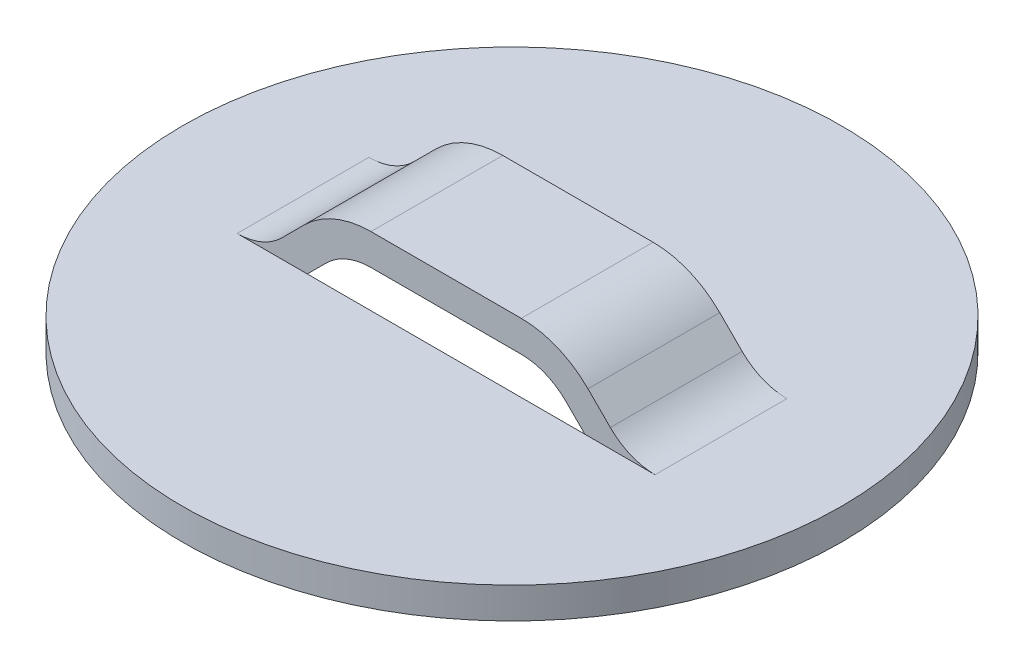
ISO-10303-21;
HEADER;
FILE_DESCRIPTION(('STEP AP214'),'2;1');
FILE_NAME('part.step','',(''),(''),'','','');
FILE_SCHEMA(('AUTOMOTIVE_DESIGN { 1 0 10303 214 1 1 1 1 }'));
ENDSEC;
DATA;
#1=APPLICATION_CONTEXT('core data for automotive mechanical design processes');
#2=APPLICATION_PROTOCOL_DEFINITION('international standard','automotive_design',2000,#1);
#3=PRODUCT_CONTEXT('',#1,'mechanical');
#4=PRODUCT('Part','Part','',(#3));
#5=PRODUCT_RELATED_PRODUCT_CATEGORY('part','',(#4));
#6=PRODUCT_DEFINITION_FORMATION('','',#4);
#7=PRODUCT_DEFINITION_CONTEXT('part definition',#1,'design');
#8=PRODUCT_DEFINITION('design','',#6,#7);
#9=PRODUCT_DEFINITION_SHAPE('','',#8);
#10=(LENGTH_UNIT() NAMED_UNIT(*) SI_UNIT(.MILLI.,.METRE.));
#11=(NAMED_UNIT(*) PLANE_ANGLE_UNIT() SI_UNIT($,.RADIAN.));
#12=(NAMED_UNIT(*) SI_UNIT($,.STERADIAN.) SOLID_ANGLE_UNIT());
#13=UNCERTAINTY_MEASURE_WITH_UNIT(LENGTH_MEASURE(1.E-05),#10,'distance_accuracy_value','');
#14=(GEOMETRIC_REPRESENTATION_CONTEXT(3) GLOBAL_UNCERTAINTY_ASSIGNED_CONTEXT((#13)) GLOBAL_UNIT_ASSIGNED_CONTEXT((#10,
#11,#12)) REPRESENTATION_CONTEXT('',''));
#15=CARTESIAN_POINT('',(0.,0.,0.));
#16=DIRECTION('',(0.,0.,1.));
#17=DIRECTION('',(1.,0.,0.));
#18=AXIS2_PLACEMENT_3D('',#15,#16,#17);
#19=CARTESIAN_POINT('',(5.8077136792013,3.048,6.35));
#20=DIRECTION('',(0.,0.,-1.));
#21=DIRECTION('',(-1.,0.,0.));
#22=AXIS2_PLACEMENT_3D('',#19,#20,#21);
#23=PLANE('',#22);
#24=DIRECTION('',(-1.,0.,0.));
#25=VECTOR('',#24,1.);
#26=CARTESIAN_POINT('',(5.8077136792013,0.,6.35));
#27=LINE('',#26,#25);
#28=CARTESIAN_POINT('',(25.9422863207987,0.,6.35));
#29=VERTEX_POINT('',#28);
#30=CARTESIAN_POINT('',(22.5604229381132,0.,6.35));
#31=VERTEX_POINT('',#30);
#32=EDGE_CURVE('E343',#29,#31,#27,.T.);
#33=ORIENTED_EDGE('',*,*,#32,.F.);
#34=CARTESIAN_POINT('',(25.9422863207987,3.048,6.35));
#35=DIRECTION('',(0.,0.,-1.));
#36=DIRECTION('',(1.,0.,0.));
#37=AXIS2_PLACEMENT_3D('',#34,#35,#36);
#38=CIRCLE('',#37,3.048);
#39=CARTESIAN_POINT('',(23.7870248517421,0.89273853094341,6.35));
#40=VERTEX_POINT('',#39);
#41=EDGE_CURVE('E279',#29,#40,#38,.T.);
#42=ORIENTED_EDGE('',*,*,#41,.T.);
#43=DIRECTION('',(-0.707106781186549,0.707106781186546,0.));
#44=VECTOR('',#43,1.);
#45=CARTESIAN_POINT('',(22.7094316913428,1.97033169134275,6.35));
#46=LINE('',#45,#44);
#47=CARTESIAN_POINT('',(22.7094316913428,1.97033169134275,6.35));
#48=VERTEX_POINT('',#47);
#49=EDGE_CURVE('E281',#40,#48,#46,.T.);
#50=ORIENTED_EDGE('',*,*,#49,.T.);
#51=CARTESIAN_POINT('',(19.4945,-1.2446,6.35));
#52=DIRECTION('',(0.,0.,1.));
#53=DIRECTION('',(-1.,0.,0.));
#54=AXIS2_PLACEMENT_3D('',#51,#52,#53);
#55=CIRCLE('',#54,4.5466);
#56=CARTESIAN_POINT('',(19.4945,3.302,6.35));
#57=VERTEX_POINT('',#56);
#58=EDGE_CURVE('E283',#48,#57,#55,.T.);
#59=ORIENTED_EDGE('',*,*,#58,.T.);
#60=DIRECTION('',(-1.,0.,0.));
#61=VECTOR('',#60,1.);
#62=CARTESIAN_POINT('',(12.2555,3.302,6.35));
#63=LINE('',#62,#61);
#64=CARTESIAN_POINT('',(12.2555,3.302,6.35));
#65=VERTEX_POINT('',#64);
#66=EDGE_CURVE('E285',#57,#65,#63,.T.);
#67=ORIENTED_EDGE('',*,*,#66,.T.);
#68=CARTESIAN_POINT('',(12.2555,-1.2446,6.35));
#69=DIRECTION('',(0.,0.,1.));
#70=DIRECTION('',(-1.,0.,0.));
#71=AXIS2_PLACEMENT_3D('',#68,#69,#70);
#72=CIRCLE('',#71,4.5466);
#73=CARTESIAN_POINT('',(9.04056830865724,1.97033169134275,6.35));
#74=VERTEX_POINT('',#73);
#75=EDGE_CURVE('E287',#65,#74,#72,.T.);
#76=ORIENTED_EDGE('',*,*,#75,.T.);
#77=DIRECTION('',(-0.707106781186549,-0.707106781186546,0.));
#78=VECTOR('',#77,1.);
#79=CARTESIAN_POINT('',(7.9629751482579,0.89273853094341,6.35));
#80=LINE('',#79,#78);
#81=CARTESIAN_POINT('',(7.9629751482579,0.89273853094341,6.35));
#82=VERTEX_POINT('',#81);
#83=EDGE_CURVE('E197',#74,#82,#80,.T.);
#84=ORIENTED_EDGE('',*,*,#83,.T.);
#85=CARTESIAN_POINT('',(5.8077136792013,3.048,6.35));
#86=DIRECTION('',(0.,0.,-1.));
#87=DIRECTION('',(-1.,0.,0.));
#88=AXIS2_PLACEMENT_3D('',#85,#86,#87);
#89=CIRCLE('',#88,3.048);
#90=CARTESIAN_POINT('',(5.8077136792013,0.,6.35));
#91=VERTEX_POINT('',#90);
#92=EDGE_CURVE('E193',#82,#91,#89,.T.);
#93=ORIENTED_EDGE('',*,*,#92,.T.);
#94=CARTESIAN_POINT('',(9.18957706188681,0.,6.35));
#95=VERTEX_POINT('',#94);
#96=EDGE_CURVE('E60',#95,#91,#27,.T.);
#97=ORIENTED_EDGE('',*,*,#96,.F.);
#98=DIRECTION('',(0.707106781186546,0.707106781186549,0.));
#99=VECTOR('',#98,1.);
#100=CARTESIAN_POINT('',(9.02264537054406,-0.166931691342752,6.35));
#101=LINE('',#100,#99);
#102=CARTESIAN_POINT('',(10.1002385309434,0.910661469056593,6.35));
#103=VERTEX_POINT('',#102);
#104=EDGE_CURVE('E267',#95,#103,#101,.T.);
#105=ORIENTED_EDGE('',*,*,#104,.T.);
#106=CARTESIAN_POINT('',(12.2555,-1.2446,6.35));
#107=DIRECTION('',(0.,0.,-1.));
#108=DIRECTION('',(-1.,0.,0.));
#109=AXIS2_PLACEMENT_3D('',#106,#107,#108);
#110=CIRCLE('',#109,3.048);
#111=CARTESIAN_POINT('',(12.2555,1.8034,6.35));
#112=VERTEX_POINT('',#111);
#113=EDGE_CURVE('E270',#103,#112,#110,.T.);
#114=ORIENTED_EDGE('',*,*,#113,.T.);
#115=DIRECTION('',(1.,0.,0.));
#116=VECTOR('',#115,1.);
#117=CARTESIAN_POINT('',(12.2555,1.8034,6.35));
#118=LINE('',#117,#116);
#119=CARTESIAN_POINT('',(19.4945,1.8034,6.35));
#120=VERTEX_POINT('',#119);
#121=EDGE_CURVE('E272',#112,#120,#118,.T.);
#122=ORIENTED_EDGE('',*,*,#121,.T.);
#123=CARTESIAN_POINT('',(19.4945,-1.2446,6.35));
#124=DIRECTION('',(0.,0.,-1.));
#125=DIRECTION('',(-1.,0.,0.));
#126=AXIS2_PLACEMENT_3D('',#123,#124,#125);
#127=CIRCLE('',#126,3.048);
#128=CARTESIAN_POINT('',(21.6497614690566,0.910661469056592,6.35));
#129=VERTEX_POINT('',#128);
#130=EDGE_CURVE('E274',#120,#129,#127,.T.);
#131=ORIENTED_EDGE('',*,*,#130,.T.);
#132=DIRECTION('',(0.707106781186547,-0.707106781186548,0.));
#133=VECTOR('',#132,1.);
#134=CARTESIAN_POINT('',(21.6497614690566,0.910661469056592,6.35));
#135=LINE('',#134,#133);
#136=EDGE_CURVE('E276',#129,#31,#135,.T.);
#137=ORIENTED_EDGE('',*,*,#136,.T.);
#138=EDGE_LOOP('',(#33,#42,#50,#59,#67,#76,#84,#93,#97,#105,#114,#122,#131,#137));
#139=FACE_BOUND('',#138,.T.);
#140=ADVANCED_FACE('F37',(#139),#23,.F.);
#141=CARTESIAN_POINT('',(5.8077136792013,3.048,0.));
#142=DIRECTION('',(0.,0.,-1.));
#143=DIRECTION('',(-1.,0.,0.));
#144=AXIS2_PLACEMENT_3D('',#141,#142,#143);
#145=PLANE('',#144);
#146=CARTESIAN_POINT('',(25.9422863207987,3.048,0.));
#147=DIRECTION('',(0.,0.,-1.));
#148=DIRECTION('',(1.,0.,0.));
#149=AXIS2_PLACEMENT_3D('',#146,#147,#148);
#150=CIRCLE('',#149,3.048);
#151=CARTESIAN_POINT('',(25.9422863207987,0.,0.));
#152=VERTEX_POINT('',#151);
#153=CARTESIAN_POINT('',(23.7870248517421,0.89273853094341,0.));
#154=VERTEX_POINT('',#153);
#155=EDGE_CURVE('E306',#152,#154,#150,.T.);
#156=ORIENTED_EDGE('',*,*,#155,.F.);
#157=DIRECTION('',(-1.,0.,0.));
#158=VECTOR('',#157,1.);
#159=CARTESIAN_POINT('',(5.8077136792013,0.,0.));
#160=LINE('',#159,#158);
#161=CARTESIAN_POINT('',(22.5604229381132,0.,0.));
#162=VERTEX_POINT('',#161);
#163=EDGE_CURVE('E11',#152,#162,#160,.T.);
#164=ORIENTED_EDGE('',*,*,#163,.T.);
#165=DIRECTION('',(0.707106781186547,-0.707106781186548,0.));
#166=VECTOR('',#165,1.);
#167=CARTESIAN_POINT('',(21.6497614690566,0.910661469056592,0.));
#168=LINE('',#167,#166);
#169=CARTESIAN_POINT('',(21.6497614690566,0.910661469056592,0.));
#170=VERTEX_POINT('',#169);
#171=EDGE_CURVE('E300',#170,#162,#168,.T.);
#172=ORIENTED_EDGE('',*,*,#171,.F.);
#173=CARTESIAN_POINT('',(19.4945,-1.2446,0.));
#174=DIRECTION('',(0.,0.,-1.));
#175=DIRECTION('',(-1.,0.,0.));
#176=AXIS2_PLACEMENT_3D('',#173,#174,#175);
#177=CIRCLE('',#176,3.048);
#178=CARTESIAN_POINT('',(19.4945,1.8034,0.));
#179=VERTEX_POINT('',#178);
#180=EDGE_CURVE('E297',#179,#170,#177,.T.);
#181=ORIENTED_EDGE('',*,*,#180,.F.);
#182=DIRECTION('',(1.,0.,0.));
#183=VECTOR('',#182,1.);
#184=CARTESIAN_POINT('',(12.2555,1.8034,0.));
#185=LINE('',#184,#183);
#186=CARTESIAN_POINT('',(12.2555,1.8034,0.));
#187=VERTEX_POINT('',#186);
#188=EDGE_CURVE('E295',#187,#179,#185,.T.);
#189=ORIENTED_EDGE('',*,*,#188,.F.);
#190=CARTESIAN_POINT('',(12.2555,-1.2446,0.));
#191=DIRECTION('',(0.,0.,-1.));
#192=DIRECTION('',(-1.,0.,0.));
#193=AXIS2_PLACEMENT_3D('',#190,#191,#192);
#194=CIRCLE('',#193,3.048);
#195=CARTESIAN_POINT('',(10.1002385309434,0.910661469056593,0.));
#196=VERTEX_POINT('',#195);
#197=EDGE_CURVE('E293',#196,#187,#194,.T.);
#198=ORIENTED_EDGE('',*,*,#197,.F.);
#199=DIRECTION('',(0.707106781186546,0.707106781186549,0.));
#200=VECTOR('',#199,1.);
#201=CARTESIAN_POINT('',(9.02264537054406,-0.166931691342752,0.));
#202=LINE('',#201,#200);
#203=CARTESIAN_POINT('',(9.18957706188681,0.,0.));
#204=VERTEX_POINT('',#203);
#205=EDGE_CURVE('E171',#204,#196,#202,.T.);
#206=ORIENTED_EDGE('',*,*,#205,.F.);
#207=DIRECTION('',(1.,0.,0.));
#208=VECTOR('',#207,1.);
#209=CARTESIAN_POINT('',(5.8077136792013,0.,0.));
#210=LINE('',#209,#208);
#211=CARTESIAN_POINT('',(5.8077136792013,0.,0.));
#212=VERTEX_POINT('',#211);
#213=EDGE_CURVE('E164',#212,#204,#210,.T.);
#214=ORIENTED_EDGE('',*,*,#213,.F.);
#215=CARTESIAN_POINT('',(5.8077136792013,3.048,0.));
#216=DIRECTION('',(0.,0.,-1.));
#217=DIRECTION('',(-1.,0.,0.));
#218=AXIS2_PLACEMENT_3D('',#215,#216,#217);
#219=CIRCLE('',#218,3.048);
#220=CARTESIAN_POINT('',(7.9629751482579,0.89273853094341,0.));
#221=VERTEX_POINT('',#220);
#222=EDGE_CURVE('E169',#221,#212,#219,.T.);
#223=ORIENTED_EDGE('',*,*,#222,.F.);
#224=DIRECTION('',(-0.707106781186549,-0.707106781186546,0.));
#225=VECTOR('',#224,1.);
#226=CARTESIAN_POINT('',(7.9629751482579,0.89273853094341,0.));
#227=LINE('',#226,#225);
#228=CARTESIAN_POINT('',(9.04056830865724,1.97033169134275,0.));
#229=VERTEX_POINT('',#228);
#230=EDGE_CURVE('E188',#229,#221,#227,.T.);
#231=ORIENTED_EDGE('',*,*,#230,.F.);
#232=CARTESIAN_POINT('',(12.2555,-1.2446,0.));
#233=DIRECTION('',(0.,0.,1.));
#234=DIRECTION('',(-1.,0.,0.));
#235=AXIS2_PLACEMENT_3D('',#232,#233,#234);
#236=CIRCLE('',#235,4.5466);
#237=CARTESIAN_POINT('',(12.2555,3.302,0.));
#238=VERTEX_POINT('',#237);
#239=EDGE_CURVE('E314',#238,#229,#236,.T.);
#240=ORIENTED_EDGE('',*,*,#239,.F.);
#241=DIRECTION('',(-1.,0.,0.));
#242=VECTOR('',#241,1.);
#243=CARTESIAN_POINT('',(12.2555,3.302,0.));
#244=LINE('',#243,#242);
#245=CARTESIAN_POINT('',(19.4945,3.302,0.));
#246=VERTEX_POINT('',#245);
#247=EDGE_CURVE('E312',#246,#238,#244,.T.);
#248=ORIENTED_EDGE('',*,*,#247,.F.);
#249=CARTESIAN_POINT('',(19.4945,-1.2446,0.));
#250=DIRECTION('',(0.,0.,1.));
#251=DIRECTION('',(-1.,0.,0.));
#252=AXIS2_PLACEMENT_3D('',#249,#250,#251);
#253=CIRCLE('',#252,4.5466);
#254=CARTESIAN_POINT('',(22.7094316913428,1.97033169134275,0.));
#255=VERTEX_POINT('',#254);
#256=EDGE_CURVE('E310',#255,#246,#253,.T.);
#257=ORIENTED_EDGE('',*,*,#256,.F.);
#258=DIRECTION('',(-0.707106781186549,0.707106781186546,0.));
#259=VECTOR('',#258,1.);
#260=CARTESIAN_POINT('',(22.7094316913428,1.97033169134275,0.));
#261=LINE('',#260,#259);
#262=EDGE_CURVE('E308',#154,#255,#261,.T.);
#263=ORIENTED_EDGE('',*,*,#262,.F.);
#264=EDGE_LOOP('',(#156,#164,#172,#181,#189,#198,#206,#214,#223,#231,#240,#248,#257,#263));
#265=FACE_BOUND('',#264,.T.);
#266=ADVANCED_FACE('F167',(#265),#145,.T.);
#267=CARTESIAN_POINT('',(5.8077136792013,3.048,6.35));
#268=DIRECTION('',(0.,0.,-1.));
#269=DIRECTION('',(-1.,0.,0.));
#270=AXIS2_PLACEMENT_3D('',#267,#268,#269);
#271=CYLINDRICAL_SURFACE('',#270,4.5466);
#272=CARTESIAN_POINT('',(5.8077136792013,3.048,0.));
#273=DIRECTION('',(0.,0.,1.));
#274=DIRECTION('',(-1.,0.,0.));
#275=AXIS2_PLACEMENT_3D('',#272,#273,#274);
#276=CIRCLE('',#275,4.5466);
#277=CARTESIAN_POINT('',(5.8077136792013,-1.4986,0.));
#278=VERTEX_POINT('',#277);
#279=CARTESIAN_POINT('',(9.02264537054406,-0.166931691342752,0.));
#280=VERTEX_POINT('',#279);
#281=EDGE_CURVE('E243',#278,#280,#276,.T.);
#282=ORIENTED_EDGE('',*,*,#281,.T.);
#283=DIRECTION('',(0.,0.,-1.));
#284=VECTOR('',#283,1.);
#285=CARTESIAN_POINT('',(9.02264537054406,-0.166931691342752,6.35));
#286=LINE('',#285,#284);
#287=CARTESIAN_POINT('',(9.02264537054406,-0.166931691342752,6.35));
#288=VERTEX_POINT('',#287);
#289=EDGE_CURVE('E236',#288,#280,#286,.T.);
#290=ORIENTED_EDGE('',*,*,#289,.F.);
#291=CARTESIAN_POINT('',(5.8077136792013,3.048,6.35));
#292=DIRECTION('',(0.,0.,1.));
#293=DIRECTION('',(-1.,0.,0.));
#294=AXIS2_PLACEMENT_3D('',#291,#292,#293);
#295=CIRCLE('',#294,4.5466);
#296=CARTESIAN_POINT('',(5.8077136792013,-1.4986,6.35));
#297=VERTEX_POINT('',#296);
#298=EDGE_CURVE('E187',#297,#288,#295,.T.);
#299=ORIENTED_EDGE('',*,*,#298,.F.);
#300=DIRECTION('',(0.,0.,-1.));
#301=VECTOR('',#300,1.);
#302=CARTESIAN_POINT('',(5.8077136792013,-1.4986,6.35));
#303=LINE('',#302,#301);
#304=EDGE_CURVE('E45',#297,#278,#303,.T.);
#305=ORIENTED_EDGE('',*,*,#304,.T.);
#306=EDGE_LOOP('',(#282,#290,#299,#305));
#307=FACE_BOUND('',#306,.T.);
#308=ADVANCED_FACE('F39',(#307),#271,.T.);
#309=CARTESIAN_POINT('',(9.02264537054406,-0.166931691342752,6.35));
#310=DIRECTION('',(-0.707106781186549,0.707106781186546,0.));
#311=DIRECTION('',(-0.707106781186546,-0.707106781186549,0.));
#312=AXIS2_PLACEMENT_3D('',#309,#310,#311);
#313=PLANE('',#312);
#314=EDGE_CURVE('E291',#280,#204,#202,.T.);
#315=ORIENTED_EDGE('',*,*,#314,.T.);
#316=ORIENTED_EDGE('',*,*,#205,.T.);
#317=DIRECTION('',(0.,0.,-1.));
#318=VECTOR('',#317,1.);
#319=CARTESIAN_POINT('',(10.1002385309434,0.910661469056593,6.35));
#320=LINE('',#319,#318);
#321=EDGE_CURVE('E233',#103,#196,#320,.T.);
#322=ORIENTED_EDGE('',*,*,#321,.F.);
#323=ORIENTED_EDGE('',*,*,#104,.F.);
#324=EDGE_CURVE('E268',#288,#95,#101,.T.);
#325=ORIENTED_EDGE('',*,*,#324,.F.);
#326=ORIENTED_EDGE('',*,*,#289,.T.);
#327=EDGE_LOOP('',(#315,#316,#322,#323,#325,#326));
#328=FACE_BOUND('',#327,.T.);
#329=ADVANCED_FACE('F363',(#328),#313,.F.);
#330=CARTESIAN_POINT('',(12.2555,-1.2446,6.35));
#331=DIRECTION('',(0.,0.,-1.));
#332=DIRECTION('',(-1.,0.,0.));
#333=AXIS2_PLACEMENT_3D('',#330,#331,#332);
#334=CYLINDRICAL_SURFACE('',#333,3.048);
#335=ORIENTED_EDGE('',*,*,#197,.T.);
#336=DIRECTION('',(0.,0.,-1.));
#337=VECTOR('',#336,1.);
#338=CARTESIAN_POINT('',(12.2555,1.8034,6.35));
#339=LINE('',#338,#337);
#340=EDGE_CURVE('E230',#112,#187,#339,.T.);
#341=ORIENTED_EDGE('',*,*,#340,.F.);
#342=ORIENTED_EDGE('',*,*,#113,.F.);
#343=ORIENTED_EDGE('',*,*,#321,.T.);
#344=EDGE_LOOP('',(#335,#341,#342,#343));
#345=FACE_BOUND('',#344,.T.);
#346=ADVANCED_FACE('F360',(#345),#334,.F.);
#347=CARTESIAN_POINT('',(12.2555,1.8034,6.35));
#348=DIRECTION('',(0.,1.,0.));
#349=DIRECTION('',(-1.,0.,0.));
#350=AXIS2_PLACEMENT_3D('',#347,#348,#349);
#351=PLANE('',#350);
#352=ORIENTED_EDGE('',*,*,#188,.T.);
#353=DIRECTION('',(0.,0.,-1.));
#354=VECTOR('',#353,1.);
#355=CARTESIAN_POINT('',(19.4945,1.8034,6.35));
#356=LINE('',#355,#354);
#357=EDGE_CURVE('E227',#120,#179,#356,.T.);
#358=ORIENTED_EDGE('',*,*,#357,.F.);
#359=ORIENTED_EDGE('',*,*,#121,.F.);
#360=ORIENTED_EDGE('',*,*,#340,.T.);
#361=EDGE_LOOP('',(#352,#358,#359,#360));
#362=FACE_BOUND('',#361,.T.);
#363=ADVANCED_FACE('F355',(#362),#351,.F.);
#364=CARTESIAN_POINT('',(19.4945,-1.2446,6.35));
#365=DIRECTION('',(0.,0.,-1.));
#366=DIRECTION('',(-1.,0.,0.));
#367=AXIS2_PLACEMENT_3D('',#364,#365,#366);
#368=CYLINDRICAL_SURFACE('',#367,3.048);
#369=ORIENTED_EDGE('',*,*,#180,.T.);
#370=DIRECTION('',(0.,0.,-1.));
#371=VECTOR('',#370,1.);
#372=CARTESIAN_POINT('',(21.6497614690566,0.910661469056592,6.35));
#373=LINE('',#372,#371);
#374=EDGE_CURVE('E224',#129,#170,#373,.T.);
#375=ORIENTED_EDGE('',*,*,#374,.F.);
#376=ORIENTED_EDGE('',*,*,#130,.F.);
#377=ORIENTED_EDGE('',*,*,#357,.T.);
#378=EDGE_LOOP('',(#369,#375,#376,#377));
#379=FACE_BOUND('',#378,.T.);
#380=ADVANCED_FACE('F351',(#379),#368,.F.);
#381=CARTESIAN_POINT('',(21.6497614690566,0.910661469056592,6.35));
#382=DIRECTION('',(0.707106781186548,0.707106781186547,0.));
#383=DIRECTION('',(-0.707106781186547,0.707106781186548,0.));
#384=AXIS2_PLACEMENT_3D('',#381,#382,#383);
#385=PLANE('',#384);
#386=ORIENTED_EDGE('',*,*,#171,.T.);
#387=CARTESIAN_POINT('',(22.7273546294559,-0.166931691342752,0.));
#388=VERTEX_POINT('',#387);
#389=EDGE_CURVE('E299',#162,#388,#168,.T.);
#390=ORIENTED_EDGE('',*,*,#389,.T.);
#391=DIRECTION('',(0.,0.,-1.));
#392=VECTOR('',#391,1.);
#393=CARTESIAN_POINT('',(22.7273546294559,-0.16693169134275,6.35));
#394=LINE('',#393,#392);
#395=CARTESIAN_POINT('',(22.7273546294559,-0.16693169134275,6.35));
#396=VERTEX_POINT('',#395);
#397=EDGE_CURVE('E221',#396,#388,#394,.T.);
#398=ORIENTED_EDGE('',*,*,#397,.F.);
#399=EDGE_CURVE('E52',#31,#396,#135,.T.);
#400=ORIENTED_EDGE('',*,*,#399,.F.);
#401=ORIENTED_EDGE('',*,*,#136,.F.);
#402=ORIENTED_EDGE('',*,*,#374,.T.);
#403=EDGE_LOOP('',(#386,#390,#398,#400,#401,#402));
#404=FACE_BOUND('',#403,.T.);
#405=ADVANCED_FACE('F347',(#404),#385,.F.);
#406=CARTESIAN_POINT('',(25.9422863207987,3.048,6.35));
#407=DIRECTION('',(0.,0.,-1.));
#408=DIRECTION('',(-1.,0.,0.));
#409=AXIS2_PLACEMENT_3D('',#406,#407,#408);
#410=CYLINDRICAL_SURFACE('',#409,4.5466);
#411=CARTESIAN_POINT('',(25.9422863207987,3.048,0.));
#412=DIRECTION('',(0.,0.,1.));
#413=DIRECTION('',(1.,0.,0.));
#414=AXIS2_PLACEMENT_3D('',#411,#412,#413);
#415=CIRCLE('',#414,4.5466);
#416=CARTESIAN_POINT('',(25.9422863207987,-1.4986,0.));
#417=VERTEX_POINT('',#416);
#418=EDGE_CURVE('E303',#388,#417,#415,.T.);
#419=ORIENTED_EDGE('',*,*,#418,.T.);
#420=DIRECTION('',(0.,0.,-1.));
#421=VECTOR('',#420,1.);
#422=CARTESIAN_POINT('',(25.9422863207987,-1.4986,6.35));
#423=LINE('',#422,#421);
#424=CARTESIAN_POINT('',(25.9422863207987,-1.4986,6.35));
#425=VERTEX_POINT('',#424);
#426=EDGE_CURVE('E218',#425,#417,#423,.T.);
#427=ORIENTED_EDGE('',*,*,#426,.F.);
#428=CARTESIAN_POINT('',(25.9422863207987,3.048,6.35));
#429=DIRECTION('',(0.,0.,1.));
#430=DIRECTION('',(1.,0.,0.));
#431=AXIS2_PLACEMENT_3D('',#428,#429,#430);
#432=CIRCLE('',#431,4.5466);
#433=EDGE_CURVE('E256',#396,#425,#432,.T.);
#434=ORIENTED_EDGE('',*,*,#433,.F.);
#435=ORIENTED_EDGE('',*,*,#397,.T.);
#436=EDGE_LOOP('',(#419,#427,#434,#435));
#437=FACE_BOUND('',#436,.T.);
#438=ADVANCED_FACE('F370',(#437),#410,.T.);
#439=CARTESIAN_POINT('',(25.9422863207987,-1.4986,6.35));
#440=DIRECTION('',(0.,1.,0.));
#441=DIRECTION('',(-1.,0.,0.));
#442=AXIS2_PLACEMENT_3D('',#439,#440,#441);
#443=PLANE('',#442);
#444=CARTESIAN_POINT('',(15.875,-1.4986,3.175));
#445=DIRECTION('',(0.,-1.,0.));
#446=DIRECTION('',(1.,0.,0.));
#447=AXIS2_PLACEMENT_3D('',#444,#445,#446);
#448=CIRCLE('',#447,15.875);
#449=CARTESIAN_POINT('',(31.75,-1.4986,3.175));
#450=VERTEX_POINT('',#449);
#451=EDGE_CURVE('E176',#450,#450,#448,.T.);
#452=ORIENTED_EDGE('',*,*,#451,.T.);
#453=EDGE_LOOP('',(#452));
#454=FACE_BOUND('',#453,.T.);
#455=DIRECTION('',(-1.,0.,0.));
#456=VECTOR('',#455,1.);
#457=CARTESIAN_POINT('',(5.8077136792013,-1.4986,6.35));
#458=LINE('',#457,#456);
#459=EDGE_CURVE('E249',#425,#297,#458,.T.);
#460=ORIENTED_EDGE('',*,*,#459,.F.);
#461=ORIENTED_EDGE('',*,*,#426,.T.);
#462=DIRECTION('',(1.,0.,0.));
#463=VECTOR('',#462,1.);
#464=CARTESIAN_POINT('',(5.8077136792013,-1.4986,0.));
#465=LINE('',#464,#463);
#466=EDGE_CURVE('E250',#278,#417,#465,.T.);
#467=ORIENTED_EDGE('',*,*,#466,.F.);
#468=ORIENTED_EDGE('',*,*,#304,.F.);
#469=EDGE_LOOP('',(#460,#461,#467,#468));
#470=FACE_BOUND('',#469,.T.);
#471=ADVANCED_FACE('F248',(#454,#470),#443,.F.);
#472=CARTESIAN_POINT('',(25.9422863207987,3.048,6.35));
#473=DIRECTION('',(0.,0.,-1.));
#474=DIRECTION('',(-1.,0.,0.));
#475=AXIS2_PLACEMENT_3D('',#472,#473,#474);
#476=CYLINDRICAL_SURFACE('',#475,3.048);
#477=ORIENTED_EDGE('',*,*,#155,.T.);
#478=DIRECTION('',(0.,0.,-1.));
#479=VECTOR('',#478,1.);
#480=CARTESIAN_POINT('',(23.7870248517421,0.89273853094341,6.35));
#481=LINE('',#480,#479);
#482=EDGE_CURVE('E212',#40,#154,#481,.T.);
#483=ORIENTED_EDGE('',*,*,#482,.F.);
#484=ORIENTED_EDGE('',*,*,#41,.F.);
#485=DIRECTION('',(0.,0.,-1.));
#486=VECTOR('',#485,1.);
#487=CARTESIAN_POINT('',(25.9422863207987,0.,6.35));
#488=LINE('',#487,#486);
#489=EDGE_CURVE('E215',#29,#152,#488,.T.);
#490=ORIENTED_EDGE('',*,*,#489,.T.);
#491=EDGE_LOOP('',(#477,#483,#484,#490));
#492=FACE_BOUND('',#491,.T.);
#493=ADVANCED_FACE('F341',(#492),#476,.F.);
#494=CARTESIAN_POINT('',(22.7094316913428,1.97033169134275,6.35));
#495=DIRECTION('',(-0.707106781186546,-0.707106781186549,0.));
#496=DIRECTION('',(0.707106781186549,-0.707106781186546,0.));
#497=AXIS2_PLACEMENT_3D('',#494,#495,#496);
#498=PLANE('',#497);
#499=ORIENTED_EDGE('',*,*,#262,.T.);
#500=DIRECTION('',(0.,0.,-1.));
#501=VECTOR('',#500,1.);
#502=CARTESIAN_POINT('',(22.7094316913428,1.97033169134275,6.35));
#503=LINE('',#502,#501);
#504=EDGE_CURVE('E209',#48,#255,#503,.T.);
#505=ORIENTED_EDGE('',*,*,#504,.F.);
#506=ORIENTED_EDGE('',*,*,#49,.F.);
#507=ORIENTED_EDGE('',*,*,#482,.T.);
#508=EDGE_LOOP('',(#499,#505,#506,#507));
#509=FACE_BOUND('',#508,.T.);
#510=ADVANCED_FACE('F336',(#509),#498,.F.);
#511=CARTESIAN_POINT('',(19.4945,-1.2446,6.35));
#512=DIRECTION('',(0.,0.,-1.));
#513=DIRECTION('',(-1.,0.,0.));
#514=AXIS2_PLACEMENT_3D('',#511,#512,#513);
#515=CYLINDRICAL_SURFACE('',#514,4.5466);
#516=ORIENTED_EDGE('',*,*,#256,.T.);
#517=DIRECTION('',(0.,0.,-1.));
#518=VECTOR('',#517,1.);
#519=CARTESIAN_POINT('',(19.4945,3.302,6.35));
#520=LINE('',#519,#518);
#521=EDGE_CURVE('E206',#57,#246,#520,.T.);
#522=ORIENTED_EDGE('',*,*,#521,.F.);
#523=ORIENTED_EDGE('',*,*,#58,.F.);
#524=ORIENTED_EDGE('',*,*,#504,.T.);
#525=EDGE_LOOP('',(#516,#522,#523,#524));
#526=FACE_BOUND('',#525,.T.);
#527=ADVANCED_FACE('F332',(#526),#515,.T.);
#528=CARTESIAN_POINT('',(12.2555,3.302,6.35));
#529=DIRECTION('',(0.,-1.,0.));
#530=DIRECTION('',(0.,0.,-1.));
#531=AXIS2_PLACEMENT_3D('',#528,#529,#530);
#532=PLANE('',#531);
#533=ORIENTED_EDGE('',*,*,#247,.T.);
#534=DIRECTION('',(0.,0.,-1.));
#535=VECTOR('',#534,1.);
#536=CARTESIAN_POINT('',(12.2555,3.302,6.35));
#537=LINE('',#536,#535);
#538=EDGE_CURVE('E203',#65,#238,#537,.T.);
#539=ORIENTED_EDGE('',*,*,#538,.F.);
#540=ORIENTED_EDGE('',*,*,#66,.F.);
#541=ORIENTED_EDGE('',*,*,#521,.T.);
#542=EDGE_LOOP('',(#533,#539,#540,#541));
#543=FACE_BOUND('',#542,.T.);
#544=ADVANCED_FACE('F328',(#543),#532,.F.);
#545=CARTESIAN_POINT('',(12.2555,-1.2446,6.35));
#546=DIRECTION('',(0.,0.,-1.));
#547=DIRECTION('',(-1.,0.,0.));
#548=AXIS2_PLACEMENT_3D('',#545,#546,#547);
#549=CYLINDRICAL_SURFACE('',#548,4.5466);
#550=ORIENTED_EDGE('',*,*,#239,.T.);
#551=DIRECTION('',(0.,0.,-1.));
#552=VECTOR('',#551,1.);
#553=CARTESIAN_POINT('',(9.04056830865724,1.97033169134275,6.35));
#554=LINE('',#553,#552);
#555=EDGE_CURVE('E195',#74,#229,#554,.T.);
#556=ORIENTED_EDGE('',*,*,#555,.F.);
#557=ORIENTED_EDGE('',*,*,#75,.F.);
#558=ORIENTED_EDGE('',*,*,#538,.T.);
#559=EDGE_LOOP('',(#550,#556,#557,#558));
#560=FACE_BOUND('',#559,.T.);
#561=ADVANCED_FACE('F323',(#560),#549,.T.);
#562=CARTESIAN_POINT('',(7.9629751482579,0.89273853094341,6.35));
#563=DIRECTION('',(0.707106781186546,-0.707106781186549,0.));
#564=DIRECTION('',(0.707106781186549,0.707106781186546,0.));
#565=AXIS2_PLACEMENT_3D('',#562,#563,#564);
#566=PLANE('',#565);
#567=ORIENTED_EDGE('',*,*,#230,.T.);
#568=DIRECTION('',(0.,0.,-1.));
#569=VECTOR('',#568,1.);
#570=CARTESIAN_POINT('',(7.9629751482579,0.89273853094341,6.35));
#571=LINE('',#570,#569);
#572=EDGE_CURVE('E186',#82,#221,#571,.T.);
#573=ORIENTED_EDGE('',*,*,#572,.F.);
#574=ORIENTED_EDGE('',*,*,#83,.F.);
#575=ORIENTED_EDGE('',*,*,#555,.T.);
#576=EDGE_LOOP('',(#567,#573,#574,#575));
#577=FACE_BOUND('',#576,.T.);
#578=ADVANCED_FACE('F316',(#577),#566,.F.);
#579=CARTESIAN_POINT('',(5.8077136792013,3.048,6.35));
#580=DIRECTION('',(0.,0.,-1.));
#581=DIRECTION('',(-1.,0.,0.));
#582=AXIS2_PLACEMENT_3D('',#579,#580,#581);
#583=CYLINDRICAL_SURFACE('',#582,3.048);
#584=ORIENTED_EDGE('',*,*,#222,.T.);
#585=DIRECTION('',(0.,0.,-1.));
#586=VECTOR('',#585,1.);
#587=CARTESIAN_POINT('',(5.8077136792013,0.,6.35));
#588=LINE('',#587,#586);
#589=EDGE_CURVE('E184',#91,#212,#588,.T.);
#590=ORIENTED_EDGE('',*,*,#589,.F.);
#591=ORIENTED_EDGE('',*,*,#92,.F.);
#592=ORIENTED_EDGE('',*,*,#572,.T.);
#593=EDGE_LOOP('',(#584,#590,#591,#592));
#594=FACE_BOUND('',#593,.T.);
#595=ADVANCED_FACE('F182',(#594),#583,.F.);
#596=CARTESIAN_POINT('',(0.,0.,6.35));
#597=DIRECTION('',(0.,-1.,0.));
#598=DIRECTION('',(0.,0.,-1.));
#599=AXIS2_PLACEMENT_3D('',#596,#597,#598);
#600=PLANE('',#599);
#601=CARTESIAN_POINT('',(15.875,0.,3.175));
#602=DIRECTION('',(0.,-1.,0.));
#603=DIRECTION('',(1.,0.,0.));
#604=AXIS2_PLACEMENT_3D('',#601,#602,#603);
#605=CIRCLE('',#604,15.875);
#606=CARTESIAN_POINT('',(31.75,0.,3.175));
#607=VERTEX_POINT('',#606);
#608=EDGE_CURVE('E261',#607,#607,#605,.T.);
#609=ORIENTED_EDGE('',*,*,#608,.F.);
#610=EDGE_LOOP('',(#609));
#611=FACE_BOUND('',#610,.T.);
#612=ORIENTED_EDGE('',*,*,#489,.F.);
#613=ORIENTED_EDGE('',*,*,#32,.T.);
#614=EDGE_CURVE('E367',#31,#95,#27,.T.);
#615=ORIENTED_EDGE('',*,*,#614,.T.);
#616=ORIENTED_EDGE('',*,*,#96,.T.);
#617=ORIENTED_EDGE('',*,*,#589,.T.);
#618=ORIENTED_EDGE('',*,*,#213,.T.);
#619=EDGE_CURVE('E177',#204,#162,#210,.T.);
#620=ORIENTED_EDGE('',*,*,#619,.T.);
#621=ORIENTED_EDGE('',*,*,#163,.F.);
#622=EDGE_LOOP('',(#612,#613,#615,#616,#617,#618,#620,#621));
#623=FACE_BOUND('',#622,.T.);
#624=ADVANCED_FACE('F191',(#611,#623),#600,.F.);
#625=CARTESIAN_POINT('',(5.8077136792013,0.,0.));
#626=DIRECTION('',(0.,0.,-1.));
#627=DIRECTION('',(-1.,0.,0.));
#628=AXIS2_PLACEMENT_3D('',#625,#626,#627);
#629=PLANE('',#628);
#630=ORIENTED_EDGE('',*,*,#314,.F.);
#631=ORIENTED_EDGE('',*,*,#281,.F.);
#632=ORIENTED_EDGE('',*,*,#466,.T.);
#633=ORIENTED_EDGE('',*,*,#418,.F.);
#634=ORIENTED_EDGE('',*,*,#389,.F.);
#635=ORIENTED_EDGE('',*,*,#619,.F.);
#636=EDGE_LOOP('',(#630,#631,#632,#633,#634,#635));
#637=FACE_BOUND('',#636,.T.);
#638=ADVANCED_FACE('F366',(#637),#629,.F.);
#639=CARTESIAN_POINT('',(5.8077136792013,0.,6.35));
#640=DIRECTION('',(0.,0.,1.));
#641=DIRECTION('',(1.,0.,0.));
#642=AXIS2_PLACEMENT_3D('',#639,#640,#641);
#643=PLANE('',#642);
#644=ORIENTED_EDGE('',*,*,#459,.T.);
#645=ORIENTED_EDGE('',*,*,#298,.T.);
#646=ORIENTED_EDGE('',*,*,#324,.T.);
#647=ORIENTED_EDGE('',*,*,#614,.F.);
#648=ORIENTED_EDGE('',*,*,#399,.T.);
#649=ORIENTED_EDGE('',*,*,#433,.T.);
#650=EDGE_LOOP('',(#644,#645,#646,#647,#648,#649));
#651=FACE_BOUND('',#650,.T.);
#652=ADVANCED_FACE('F253',(#651),#643,.F.);
#653=CARTESIAN_POINT('',(15.875,0.,3.175));
#654=DIRECTION('',(0.,-1.,0.));
#655=DIRECTION('',(1.,0.,0.));
#656=AXIS2_PLACEMENT_3D('',#653,#654,#655);
#657=CYLINDRICAL_SURFACE('',#656,15.875);
#658=CARTESIAN_POINT('',(31.75,-1.4986,3.175));
#659=CARTESIAN_POINT('',(31.75,-1.48298958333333,3.175));
#660=CARTESIAN_POINT('',(31.75,-1.46737916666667,3.175));
#661=CARTESIAN_POINT('',(31.75,-1.43615833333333,3.175));
#662=CARTESIAN_POINT('',(31.75,-1.42054791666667,3.175));
#663=CARTESIAN_POINT('',(31.75,-1.38932708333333,3.175));
#664=CARTESIAN_POINT('',(31.75,-1.37371666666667,3.175));
#665=CARTESIAN_POINT('',(31.75,-1.34249583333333,3.175));
#666=CARTESIAN_POINT('',(31.75,-1.32688541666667,3.175));
#667=CARTESIAN_POINT('',(31.75,-1.29566458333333,3.175));
#668=CARTESIAN_POINT('',(31.75,-1.28005416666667,3.175));
#669=CARTESIAN_POINT('',(31.75,-1.24883333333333,3.175));
#670=CARTESIAN_POINT('',(31.75,-1.23322291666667,3.175));
#671=CARTESIAN_POINT('',(31.75,-1.20200208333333,3.175));
#672=CARTESIAN_POINT('',(31.75,-1.18639166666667,3.175));
#673=CARTESIAN_POINT('',(31.75,-1.15517083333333,3.175));
#674=CARTESIAN_POINT('',(31.75,-1.13956041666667,3.175));
#675=CARTESIAN_POINT('',(31.75,-1.10833958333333,3.175));
#676=CARTESIAN_POINT('',(31.75,-1.09272916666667,3.175));
#677=CARTESIAN_POINT('',(31.75,-1.06150833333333,3.175));
#678=CARTESIAN_POINT('',(31.75,-1.04589791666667,3.175));
#679=CARTESIAN_POINT('',(31.75,-1.01467708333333,3.175));
#680=CARTESIAN_POINT('',(31.75,-0.999066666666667,3.175));
#681=CARTESIAN_POINT('',(31.75,-0.967845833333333,3.175));
#682=CARTESIAN_POINT('',(31.75,-0.952235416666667,3.175));
#683=CARTESIAN_POINT('',(31.75,-0.921014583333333,3.175));
#684=CARTESIAN_POINT('',(31.75,-0.905404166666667,3.175));
#685=CARTESIAN_POINT('',(31.75,-0.874183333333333,3.175));
#686=CARTESIAN_POINT('',(31.75,-0.858572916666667,3.175));
#687=CARTESIAN_POINT('',(31.75,-0.827352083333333,3.175));
#688=CARTESIAN_POINT('',(31.75,-0.811741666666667,3.175));
#689=CARTESIAN_POINT('',(31.75,-0.780520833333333,3.175));
#690=CARTESIAN_POINT('',(31.75,-0.764910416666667,3.175));
#691=CARTESIAN_POINT('',(31.75,-0.733689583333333,3.175));
#692=CARTESIAN_POINT('',(31.75,-0.718079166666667,3.175));
#693=CARTESIAN_POINT('',(31.75,-0.686858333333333,3.175));
#694=CARTESIAN_POINT('',(31.75,-0.671247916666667,3.175));
#695=CARTESIAN_POINT('',(31.75,-0.640027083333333,3.175));
#696=CARTESIAN_POINT('',(31.75,-0.624416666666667,3.175));
#697=CARTESIAN_POINT('',(31.75,-0.593195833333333,3.175));
#698=CARTESIAN_POINT('',(31.75,-0.577585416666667,3.175));
#699=CARTESIAN_POINT('',(31.75,-0.546364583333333,3.175));
#700=CARTESIAN_POINT('',(31.75,-0.530754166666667,3.175));
#701=CARTESIAN_POINT('',(31.75,-0.499533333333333,3.175));
#702=CARTESIAN_POINT('',(31.75,-0.483922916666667,3.175));
#703=CARTESIAN_POINT('',(31.75,-0.452702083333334,3.175));
#704=CARTESIAN_POINT('',(31.75,-0.437091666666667,3.175));
#705=CARTESIAN_POINT('',(31.75,-0.405870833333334,3.175));
#706=CARTESIAN_POINT('',(31.75,-0.390260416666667,3.175));
#707=CARTESIAN_POINT('',(31.75,-0.359039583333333,3.175));
#708=CARTESIAN_POINT('',(31.75,-0.343429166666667,3.175));
#709=CARTESIAN_POINT('',(31.75,-0.312208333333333,3.175));
#710=CARTESIAN_POINT('',(31.75,-0.296597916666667,3.175));
#711=CARTESIAN_POINT('',(31.75,-0.265377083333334,3.175));
#712=CARTESIAN_POINT('',(31.75,-0.249766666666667,3.175));
#713=CARTESIAN_POINT('',(31.75,-0.218545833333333,3.175));
#714=CARTESIAN_POINT('',(31.75,-0.202935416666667,3.175));
#715=CARTESIAN_POINT('',(31.75,-0.171714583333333,3.175));
#716=CARTESIAN_POINT('',(31.75,-0.156104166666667,3.175));
#717=CARTESIAN_POINT('',(31.75,-0.124883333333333,3.175));
#718=CARTESIAN_POINT('',(31.75,-0.109272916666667,3.175));
#719=CARTESIAN_POINT('',(31.75,-0.0780520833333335,3.175));
#720=CARTESIAN_POINT('',(31.75,-0.0624416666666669,3.175));
#721=CARTESIAN_POINT('',(31.75,-0.0312208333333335,3.175));
#722=CARTESIAN_POINT('',(31.75,-0.0156104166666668,3.175));
#723=CARTESIAN_POINT('',(31.75,0.,3.175));
#724=B_SPLINE_CURVE_WITH_KNOTS('',3,(#658,#659,#660,#661,#662,#663,#664,#665,#666,#667,#668,
#669,#670,#671,#672,#673,#674,#675,#676,#677,#678,#679,#680,#681,#682,#683,#684,#685,#686,#687,
#688,#689,#690,#691,#692,#693,#694,#695,#696,#697,#698,#699,#700,#701,#702,#703,#704,#705,#706,
#707,#708,#709,#710,#711,#712,#713,#714,#715,#716,#717,#718,#719,#720,#721,#722,#723),
.UNSPECIFIED.,.F.,.F.,(4,2,2,2,2,2,2,2,2,2,2,2,2,2,2,2,2,2,2,2,2,2,2,2,2,2,2,2,2,2,2,2,4),(0.,
0.0468312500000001,0.0936625,0.14049375,0.187325,0.23415625,0.2809875,0.32781875,0.37465,
0.42148125,0.4683125,0.51514375,0.561975,0.60880625,0.6556375,0.70246875,0.7493,0.79613125,
0.8429625,0.88979375,0.936625,0.98345625,1.0302875,1.07711875,1.12395,1.17078125,1.2176125,
1.26444375,1.311275,1.35810625,1.4049375,1.45176875,1.4986),.UNSPECIFIED.);
#725=EDGE_CURVE('BSEAM387',#450,#607,#724,.T.);
#726=ORIENTED_EDGE('',*,*,#451,.F.);
#727=ORIENTED_EDGE('',*,*,#608,.T.);
#728=ORIENTED_EDGE('',*,*,#725,.T.);
#729=ORIENTED_EDGE('',*,*,#725,.F.);
#730=EDGE_LOOP('',(#726,#728,#727,#729));
#731=FACE_BOUND('',#730,.T.);
#732=ADVANCED_FACE('F387',(#731),#657,.T.);
#733=CLOSED_SHELL('',(#140,#266,#308,#329,#346,#363,#380,#405,#438,#471,#493,#510,#527,#544,
#561,#578,#595,#624,#638,#652,#732));
#734=MANIFOLD_SOLID_BREP('B2',#733);
#735=ADVANCED_BREP_SHAPE_REPRESENTATION('',(#18,#734),#14);
#736=SHAPE_DEFINITION_REPRESENTATION(#9,#735);
ENDSEC;
END-ISO-10303-21;
